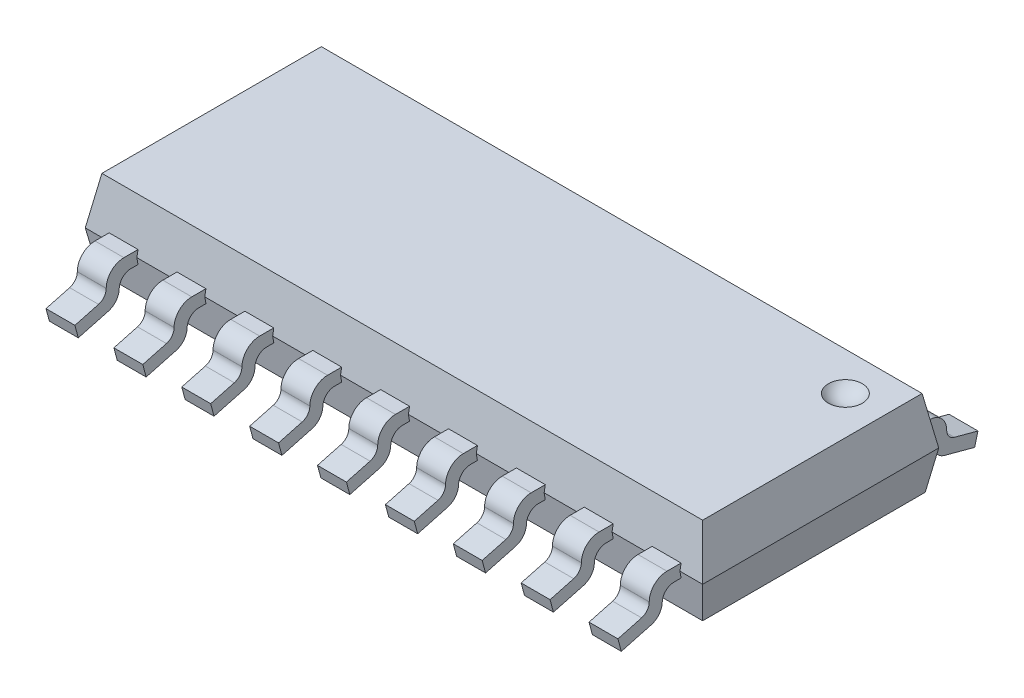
from build123d import *

# Parameters (mm, degrees)
BOSS_EXTRUDE1_DEPTH  = 5.23
CUT_EXTRUDE1_DEPTH   = 4.375
BOSS_EXTRUDE3_DEPTH  = 0.245
LPATTERN1_COUNT      = 5
LPATTERN1_PITCH      = 1.15
LPATTERN1_COL_COUNT  = 5
LPATTERN1_COL_PITCH  = 1.15
MIRROR1_COPY_1_DEPTH = 0.245
MIRROR1_COPY_2_DEPTH = 0.245
MIRROR1_COPY_3_DEPTH = 0.245
MIRROR1_COPY_4_DEPTH = 0.245
MIRROR1_COPY_5_DEPTH = 0.245
MIRROR1_COPY_6_DEPTH = 0.245
MIRROR1_COPY_7_DEPTH = 0.245
MIRROR1_COPY_8_DEPTH = 0.245


with BuildPart() as part:
    # Sketch3 → Boss-Extrude1 (new, symmetric)
    with BuildSketch(Plane(origin=(0, 0, 0), x_dir=(0, 0, -1), z_dir=(1, 0, 0))):
        Polygon((-2, 0), (-1.885387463, -0.65), (1.885387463, -0.65), (2, 0), (1.858938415, 0.8), (-1.858938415, 0.8), align=None)
    extrude(amount=BOSS_EXTRUDE1_DEPTH, both=True)

    # Sketch4 → Cut-Extrude1 (cut, symmetric)
    with BuildSketch(Plane.XY):
        Polygon((-5.23, 0), (-5.088938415, 0.8), (-6, 0.8), (-6, -0.65), (-5.115387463, -0.65), align=None)
        Polygon((6, -0.65), (6, 0.8), (5.088938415, 0.8), (5.23, 0), (5.115387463, -0.65), align=None)
    extrude(amount=CUT_EXTRUDE1_DEPTH, both=True, mode=Mode.SUBTRACT)

    # Sketch8 → Boss-Extrude3 (add, symmetric)
    with BuildSketch(Plane(origin=(0, 0, 0), x_dir=(0, 0, -1), z_dir=(1, 0, 0))):
        with BuildLine():
            Line((-2, 0), (-1.980604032, 0.11))
            Line((-1.980604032, 0.11), (-2.22, 0.11))
            ThreePointArc((-2.22, 0.11), (-2.432132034, 0.022132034), (-2.52, -0.19))
            Line((-2.52, -0.19), (-2.52, -0.191271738))
            ThreePointArc((-2.52, -0.191271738), (-2.556144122, -0.297748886), (-2.649638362, -0.360219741))
            Line((-2.649638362, -0.360219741), (-3.05, -0.467496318))
            Line((-3.05, -0.467496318), (-2.99305981, -0.68))
            Line((-2.99305981, -0.68), (-2.485295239, -0.543944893))
            ThreePointArc((-2.485295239, -0.543944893), (-2.351661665, -0.454653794), (-2.3, -0.302463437))
            Line((-2.3, -0.302463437), (-2.3, -0.31))
            ThreePointArc((-2.3, -0.31), (-2.241421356, -0.168578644), (-2.1, -0.11))
            Line((-2.1, -0.11), (-1.980604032, -0.11))
            Line((-1.980604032, -0.11), (-2, 0))
        make_face()
    boss_extrude3 = extrude(amount=BOSS_EXTRUDE3_DEPTH, both=True)

    # Sketch9 → Cut-Revolve1 (revolve, cut)
    with BuildSketch(Plane(origin=(0, 1, 0), x_dir=(1, 0, 0), z_dir=(0, 1, 0))):
        with BuildLine():
            Line((4.788938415, 1.208938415), (4.088938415, 1.208938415))
            ThreePointArc((4.088938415, 1.208938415), (4.438938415, 1.558938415), (4.788938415, 1.208938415))
        make_face()
    revolve(axis=Axis((4.788938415, 1, -1.208938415), (-1, 0, 0)), mode=Mode.SUBTRACT)

    # LPattern1: Boss-Extrude3 ×5
    with Locations(*[(i * LPATTERN1_PITCH, 0, 0) for i in range(1, LPATTERN1_COUNT)]):
        add(boss_extrude3)

    # LPattern1 col: Boss-Extrude3 ×5
    with Locations(*[(-i * LPATTERN1_COL_PITCH, 0, 0) for i in range(1, LPATTERN1_COL_COUNT)]):
        add(boss_extrude3)

    # Mirror1: Boss-Extrude3 across plane
    add(boss_extrude3.mirror(Plane.XY))

    # Mirror1 copy 1 sketch → Mirror1 copy 1 (add, symmetric)
    with BuildSketch(Plane(origin=(1.15, 0, 0), x_dir=(0, 0, 1), z_dir=(1, 0, 0))):
        with BuildLine():
            Line((-2, 0), (-1.980604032, -0.11))
            Line((-1.980604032, -0.11), (-2.22, -0.11))
            ThreePointArc((-2.22, -0.11), (-2.432132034, -0.022132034), (-2.52, 0.19))
            Line((-2.52, 0.19), (-2.52, 0.191271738))
            ThreePointArc((-2.52, 0.191271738), (-2.556144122, 0.297748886), (-2.649638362, 0.360219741))
            Line((-2.649638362, 0.360219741), (-3.05, 0.467496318))
            Line((-3.05, 0.467496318), (-2.99305981, 0.68))
            Line((-2.99305981, 0.68), (-2.485295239, 0.543944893))
            ThreePointArc((-2.485295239, 0.543944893), (-2.351661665, 0.454653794), (-2.3, 0.302463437))
            Line((-2.3, 0.302463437), (-2.3, 0.31))
            ThreePointArc((-2.3, 0.31), (-2.241421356, 0.168578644), (-2.1, 0.11))
            Line((-2.1, 0.11), (-1.980604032, 0.11))
            Line((-1.980604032, 0.11), (-2, 0))
        make_face()
    extrude(amount=MIRROR1_COPY_1_DEPTH, both=True)

    # Mirror1 copy 2 sketch → Mirror1 copy 2 (add, symmetric)
    with BuildSketch(Plane(origin=(2.3, 0, 0), x_dir=(0, 0, 1), z_dir=(1, 0, 0))):
        with BuildLine():
            Line((-2, 0), (-1.980604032, -0.11))
            Line((-1.980604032, -0.11), (-2.22, -0.11))
            ThreePointArc((-2.22, -0.11), (-2.432132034, -0.022132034), (-2.52, 0.19))
            Line((-2.52, 0.19), (-2.52, 0.191271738))
            ThreePointArc((-2.52, 0.191271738), (-2.556144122, 0.297748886), (-2.649638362, 0.360219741))
            Line((-2.649638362, 0.360219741), (-3.05, 0.467496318))
            Line((-3.05, 0.467496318), (-2.99305981, 0.68))
            Line((-2.99305981, 0.68), (-2.485295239, 0.543944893))
            ThreePointArc((-2.485295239, 0.543944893), (-2.351661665, 0.454653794), (-2.3, 0.302463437))
            Line((-2.3, 0.302463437), (-2.3, 0.31))
            ThreePointArc((-2.3, 0.31), (-2.241421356, 0.168578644), (-2.1, 0.11))
            Line((-2.1, 0.11), (-1.980604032, 0.11))
            Line((-1.980604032, 0.11), (-2, 0))
        make_face()
    extrude(amount=MIRROR1_COPY_2_DEPTH, both=True)

    # Mirror1 copy 3 sketch → Mirror1 copy 3 (add, symmetric)
    with BuildSketch(Plane(origin=(3.45, 0, 0), x_dir=(0, 0, 1), z_dir=(1, 0, 0))):
        with BuildLine():
            Line((-2, 0), (-1.980604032, -0.11))
            Line((-1.980604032, -0.11), (-2.22, -0.11))
            ThreePointArc((-2.22, -0.11), (-2.432132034, -0.022132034), (-2.52, 0.19))
            Line((-2.52, 0.19), (-2.52, 0.191271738))
            ThreePointArc((-2.52, 0.191271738), (-2.556144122, 0.297748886), (-2.649638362, 0.360219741))
            Line((-2.649638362, 0.360219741), (-3.05, 0.467496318))
            Line((-3.05, 0.467496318), (-2.99305981, 0.68))
            Line((-2.99305981, 0.68), (-2.485295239, 0.543944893))
            ThreePointArc((-2.485295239, 0.543944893), (-2.351661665, 0.454653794), (-2.3, 0.302463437))
            Line((-2.3, 0.302463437), (-2.3, 0.31))
            ThreePointArc((-2.3, 0.31), (-2.241421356, 0.168578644), (-2.1, 0.11))
            Line((-2.1, 0.11), (-1.980604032, 0.11))
            Line((-1.980604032, 0.11), (-2, 0))
        make_face()
    extrude(amount=MIRROR1_COPY_3_DEPTH, both=True)

    # Mirror1 copy 4 sketch → Mirror1 copy 4 (add, symmetric)
    with BuildSketch(Plane(origin=(4.6, 0, 0), x_dir=(0, 0, 1), z_dir=(1, 0, 0))):
        with BuildLine():
            Line((-2, 0), (-1.980604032, -0.11))
            Line((-1.980604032, -0.11), (-2.22, -0.11))
            ThreePointArc((-2.22, -0.11), (-2.432132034, -0.022132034), (-2.52, 0.19))
            Line((-2.52, 0.19), (-2.52, 0.191271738))
            ThreePointArc((-2.52, 0.191271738), (-2.556144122, 0.297748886), (-2.649638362, 0.360219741))
            Line((-2.649638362, 0.360219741), (-3.05, 0.467496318))
            Line((-3.05, 0.467496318), (-2.99305981, 0.68))
            Line((-2.99305981, 0.68), (-2.485295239, 0.543944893))
            ThreePointArc((-2.485295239, 0.543944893), (-2.351661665, 0.454653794), (-2.3, 0.302463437))
            Line((-2.3, 0.302463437), (-2.3, 0.31))
            ThreePointArc((-2.3, 0.31), (-2.241421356, 0.168578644), (-2.1, 0.11))
            Line((-2.1, 0.11), (-1.980604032, 0.11))
            Line((-1.980604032, 0.11), (-2, 0))
        make_face()
    extrude(amount=MIRROR1_COPY_4_DEPTH, both=True)

    # Mirror1 copy 5 sketch → Mirror1 copy 5 (add, symmetric)
    with BuildSketch(Plane(origin=(-1.15, 0, 0), x_dir=(0, 0, 1), z_dir=(1, 0, 0))):
        with BuildLine():
            Line((-2, 0), (-1.980604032, -0.11))
            Line((-1.980604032, -0.11), (-2.22, -0.11))
            ThreePointArc((-2.22, -0.11), (-2.432132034, -0.022132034), (-2.52, 0.19))
            Line((-2.52, 0.19), (-2.52, 0.191271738))
            ThreePointArc((-2.52, 0.191271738), (-2.556144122, 0.297748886), (-2.649638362, 0.360219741))
            Line((-2.649638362, 0.360219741), (-3.05, 0.467496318))
            Line((-3.05, 0.467496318), (-2.99305981, 0.68))
            Line((-2.99305981, 0.68), (-2.485295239, 0.543944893))
            ThreePointArc((-2.485295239, 0.543944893), (-2.351661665, 0.454653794), (-2.3, 0.302463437))
            Line((-2.3, 0.302463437), (-2.3, 0.31))
            ThreePointArc((-2.3, 0.31), (-2.241421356, 0.168578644), (-2.1, 0.11))
            Line((-2.1, 0.11), (-1.980604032, 0.11))
            Line((-1.980604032, 0.11), (-2, 0))
        make_face()
    extrude(amount=MIRROR1_COPY_5_DEPTH, both=True)

    # Mirror1 copy 6 sketch → Mirror1 copy 6 (add, symmetric)
    with BuildSketch(Plane(origin=(-2.3, 0, 0), x_dir=(0, 0, 1), z_dir=(1, 0, 0))):
        with BuildLine():
            Line((-2, 0), (-1.980604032, -0.11))
            Line((-1.980604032, -0.11), (-2.22, -0.11))
            ThreePointArc((-2.22, -0.11), (-2.432132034, -0.022132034), (-2.52, 0.19))
            Line((-2.52, 0.19), (-2.52, 0.191271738))
            ThreePointArc((-2.52, 0.191271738), (-2.556144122, 0.297748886), (-2.649638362, 0.360219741))
            Line((-2.649638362, 0.360219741), (-3.05, 0.467496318))
            Line((-3.05, 0.467496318), (-2.99305981, 0.68))
            Line((-2.99305981, 0.68), (-2.485295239, 0.543944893))
            ThreePointArc((-2.485295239, 0.543944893), (-2.351661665, 0.454653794), (-2.3, 0.302463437))
            Line((-2.3, 0.302463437), (-2.3, 0.31))
            ThreePointArc((-2.3, 0.31), (-2.241421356, 0.168578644), (-2.1, 0.11))
            Line((-2.1, 0.11), (-1.980604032, 0.11))
            Line((-1.980604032, 0.11), (-2, 0))
        make_face()
    extrude(amount=MIRROR1_COPY_6_DEPTH, both=True)

    # Mirror1 copy 7 sketch → Mirror1 copy 7 (add, symmetric)
    with BuildSketch(Plane(origin=(-3.45, 0, 0), x_dir=(0, 0, 1), z_dir=(1, 0, 0))):
        with BuildLine():
            Line((-2, 0), (-1.980604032, -0.11))
            Line((-1.980604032, -0.11), (-2.22, -0.11))
            ThreePointArc((-2.22, -0.11), (-2.432132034, -0.022132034), (-2.52, 0.19))
            Line((-2.52, 0.19), (-2.52, 0.191271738))
            ThreePointArc((-2.52, 0.191271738), (-2.556144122, 0.297748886), (-2.649638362, 0.360219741))
            Line((-2.649638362, 0.360219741), (-3.05, 0.467496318))
            Line((-3.05, 0.467496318), (-2.99305981, 0.68))
            Line((-2.99305981, 0.68), (-2.485295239, 0.543944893))
            ThreePointArc((-2.485295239, 0.543944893), (-2.351661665, 0.454653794), (-2.3, 0.302463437))
            Line((-2.3, 0.302463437), (-2.3, 0.31))
            ThreePointArc((-2.3, 0.31), (-2.241421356, 0.168578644), (-2.1, 0.11))
            Line((-2.1, 0.11), (-1.980604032, 0.11))
            Line((-1.980604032, 0.11), (-2, 0))
        make_face()
    extrude(amount=MIRROR1_COPY_7_DEPTH, both=True)

    # Mirror1 copy 8 sketch → Mirror1 copy 8 (add, symmetric)
    with BuildSketch(Plane(origin=(-4.6, 0, 0), x_dir=(0, 0, 1), z_dir=(1, 0, 0))):
        with BuildLine():
            Line((-2, 0), (-1.980604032, -0.11))
            Line((-1.980604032, -0.11), (-2.22, -0.11))
            ThreePointArc((-2.22, -0.11), (-2.432132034, -0.022132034), (-2.52, 0.19))
            Line((-2.52, 0.19), (-2.52, 0.191271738))
            ThreePointArc((-2.52, 0.191271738), (-2.556144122, 0.297748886), (-2.649638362, 0.360219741))
            Line((-2.649638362, 0.360219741), (-3.05, 0.467496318))
            Line((-3.05, 0.467496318), (-2.99305981, 0.68))
            Line((-2.99305981, 0.68), (-2.485295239, 0.543944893))
            ThreePointArc((-2.485295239, 0.543944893), (-2.351661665, 0.454653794), (-2.3, 0.302463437))
            Line((-2.3, 0.302463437), (-2.3, 0.31))
            ThreePointArc((-2.3, 0.31), (-2.241421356, 0.168578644), (-2.1, 0.11))
            Line((-2.1, 0.11), (-1.980604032, 0.11))
            Line((-1.980604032, 0.11), (-2, 0))
        make_face()
    extrude(amount=MIRROR1_COPY_8_DEPTH, both=True)


solid = part.part
